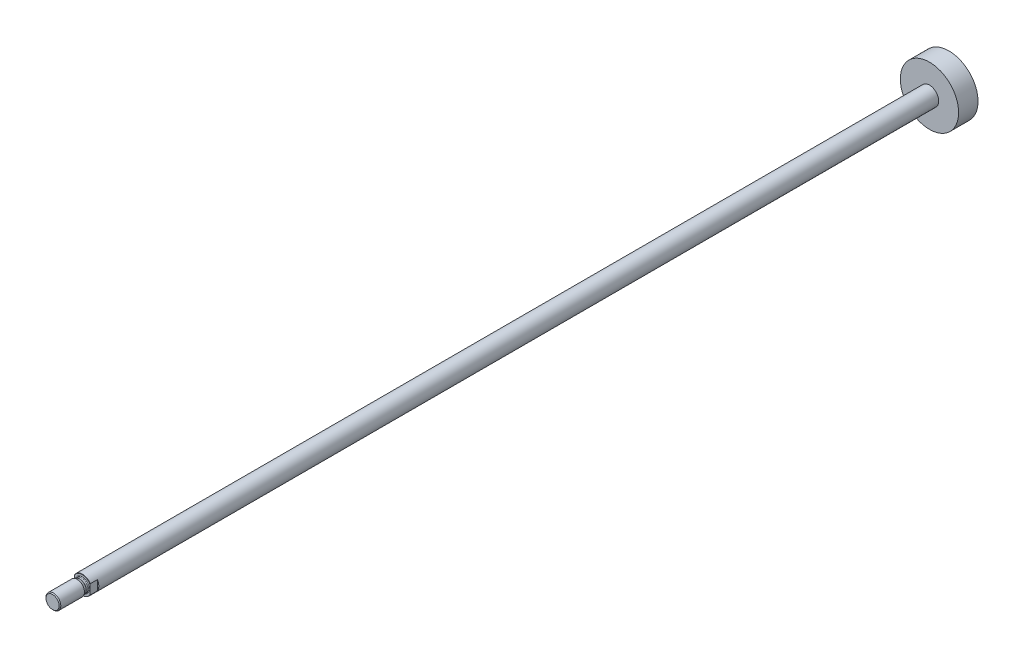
ISO-10303-21;
HEADER;
FILE_DESCRIPTION(('STEP AP214'),'2;1');
FILE_NAME('part.step','',(''),(''),'','','');
FILE_SCHEMA(('AUTOMOTIVE_DESIGN { 1 0 10303 214 1 1 1 1 }'));
ENDSEC;
DATA;
#1=APPLICATION_CONTEXT('core data for automotive mechanical design processes');
#2=APPLICATION_PROTOCOL_DEFINITION('international standard','automotive_design',2000,#1);
#3=PRODUCT_CONTEXT('',#1,'mechanical');
#4=PRODUCT('Part','Part','',(#3));
#5=PRODUCT_RELATED_PRODUCT_CATEGORY('part','',(#4));
#6=PRODUCT_DEFINITION_FORMATION('','',#4);
#7=PRODUCT_DEFINITION_CONTEXT('part definition',#1,'design');
#8=PRODUCT_DEFINITION('design','',#6,#7);
#9=PRODUCT_DEFINITION_SHAPE('','',#8);
#10=(LENGTH_UNIT() NAMED_UNIT(*) SI_UNIT(.MILLI.,.METRE.));
#11=(NAMED_UNIT(*) PLANE_ANGLE_UNIT() SI_UNIT($,.RADIAN.));
#12=(NAMED_UNIT(*) SI_UNIT($,.STERADIAN.) SOLID_ANGLE_UNIT());
#13=UNCERTAINTY_MEASURE_WITH_UNIT(LENGTH_MEASURE(1.E-05),#10,'distance_accuracy_value','');
#14=(GEOMETRIC_REPRESENTATION_CONTEXT(3) GLOBAL_UNCERTAINTY_ASSIGNED_CONTEXT((#13)) GLOBAL_UNIT_ASSIGNED_CONTEXT((#10,
#11,#12)) REPRESENTATION_CONTEXT('',''));
#15=CARTESIAN_POINT('',(0.,0.,0.));
#16=DIRECTION('',(0.,0.,1.));
#17=DIRECTION('',(1.,0.,0.));
#18=AXIS2_PLACEMENT_3D('',#15,#16,#17);
#19=CARTESIAN_POINT('',(0.,31.5,-580.5));
#20=DIRECTION('',(0.,0.,1.));
#21=DIRECTION('',(1.,0.,0.));
#22=AXIS2_PLACEMENT_3D('',#19,#20,#21);
#23=PLANE('',#22);
#24=CARTESIAN_POINT('',(0.,0.,-580.5));
#25=DIRECTION('',(0.,0.,-1.));
#26=DIRECTION('',(-1.,0.,0.));
#27=AXIS2_PLACEMENT_3D('',#24,#25,#26);
#28=CIRCLE('',#27,31.5);
#29=CARTESIAN_POINT('',(-31.5,0.,-580.5));
#30=VERTEX_POINT('',#29);
#31=EDGE_CURVE('E44',#30,#30,#28,.T.);
#32=ORIENTED_EDGE('',*,*,#31,.T.);
#33=EDGE_LOOP('',(#32));
#34=FACE_BOUND('',#33,.T.);
#35=ADVANCED_FACE('F41',(#34),#23,.F.);
#36=CARTESIAN_POINT('',(0.,0.,-580.5));
#37=DIRECTION('',(0.,0.,-1.));
#38=DIRECTION('',(-1.,0.,0.));
#39=AXIS2_PLACEMENT_3D('',#36,#37,#38);
#40=CYLINDRICAL_SURFACE('',#39,31.5);
#41=ORIENTED_EDGE('',*,*,#31,.F.);
#42=EDGE_LOOP('',(#41));
#43=FACE_BOUND('',#42,.T.);
#44=CARTESIAN_POINT('',(0.,0.,-559.5));
#45=DIRECTION('',(0.,0.,-1.));
#46=DIRECTION('',(-1.,0.,0.));
#47=AXIS2_PLACEMENT_3D('',#44,#45,#46);
#48=CIRCLE('',#47,31.5);
#49=CARTESIAN_POINT('',(-31.5,0.,-559.5));
#50=VERTEX_POINT('',#49);
#51=EDGE_CURVE('E51',#50,#50,#48,.T.);
#52=ORIENTED_EDGE('',*,*,#51,.T.);
#53=EDGE_LOOP('',(#52));
#54=FACE_BOUND('',#53,.T.);
#55=ADVANCED_FACE('F147',(#43,#54),#40,.T.);
#56=CARTESIAN_POINT('',(0.,10.,-559.5));
#57=DIRECTION('',(0.,0.,-1.));
#58=DIRECTION('',(0.,-1.,0.));
#59=AXIS2_PLACEMENT_3D('',#56,#57,#58);
#60=PLANE('',#59);
#61=ORIENTED_EDGE('',*,*,#51,.F.);
#62=EDGE_LOOP('',(#61));
#63=FACE_BOUND('',#62,.T.);
#64=CARTESIAN_POINT('',(0.,0.,-559.5));
#65=DIRECTION('',(0.,0.,-1.));
#66=DIRECTION('',(-1.,0.,0.));
#67=AXIS2_PLACEMENT_3D('',#64,#65,#66);
#68=CIRCLE('',#67,10.);
#69=CARTESIAN_POINT('',(-10.,0.,-559.5));
#70=VERTEX_POINT('',#69);
#71=EDGE_CURVE('E11',#70,#70,#68,.T.);
#72=ORIENTED_EDGE('',*,*,#71,.T.);
#73=EDGE_LOOP('',(#72));
#74=FACE_BOUND('',#73,.T.);
#75=ADVANCED_FACE('F329',(#63,#74),#60,.F.);
#76=CARTESIAN_POINT('',(0.,0.,-580.5));
#77=DIRECTION('',(0.,0.,-1.));
#78=DIRECTION('',(-1.,0.,0.));
#79=AXIS2_PLACEMENT_3D('',#76,#77,#78);
#80=CYLINDRICAL_SURFACE('',#79,10.);
#81=ORIENTED_EDGE('',*,*,#71,.F.);
#82=EDGE_LOOP('',(#81));
#83=FACE_BOUND('',#82,.T.);
#84=DIRECTION('',(0.,0.,-1.));
#85=VECTOR('',#84,1.);
#86=CARTESIAN_POINT('',(8.5,-5.26782687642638,-260.5));
#87=LINE('',#86,#85);
#88=CARTESIAN_POINT('',(8.5,-5.26782687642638,355.817157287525));
#89=VERTEX_POINT('',#88);
#90=CARTESIAN_POINT('',(8.5,-5.26782687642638,348.1));
#91=VERTEX_POINT('',#90);
#92=EDGE_CURVE('E189',#89,#91,#87,.T.);
#93=ORIENTED_EDGE('',*,*,#92,.F.);
#94=CARTESIAN_POINT('',(0.,0.,355.817157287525));
#95=DIRECTION('',(0.,0.,-1.));
#96=DIRECTION('',(-1.,0.,0.));
#97=AXIS2_PLACEMENT_3D('',#94,#95,#96);
#98=CIRCLE('',#97,10.);
#99=CARTESIAN_POINT('',(-8.5,-5.26782687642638,355.817157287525));
#100=VERTEX_POINT('',#99);
#101=EDGE_CURVE('E171',#89,#100,#98,.T.);
#102=ORIENTED_EDGE('',*,*,#101,.T.);
#103=DIRECTION('',(0.,0.,1.));
#104=VECTOR('',#103,1.);
#105=CARTESIAN_POINT('',(-8.5,-5.26782687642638,-260.5));
#106=LINE('',#105,#104);
#107=CARTESIAN_POINT('',(-8.5,-5.26782687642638,348.1));
#108=VERTEX_POINT('',#107);
#109=EDGE_CURVE('E235',#108,#100,#106,.T.);
#110=ORIENTED_EDGE('',*,*,#109,.F.);
#111=CARTESIAN_POINT('',(0.,0.,348.1));
#112=DIRECTION('',(0.,0.,1.));
#113=DIRECTION('',(1.,0.,0.));
#114=AXIS2_PLACEMENT_3D('',#111,#112,#113);
#115=CIRCLE('',#114,10.);
#116=CARTESIAN_POINT('',(-8.5,5.26782687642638,348.1));
#117=VERTEX_POINT('',#116);
#118=EDGE_CURVE('E183',#117,#108,#115,.T.);
#119=ORIENTED_EDGE('',*,*,#118,.F.);
#120=DIRECTION('',(0.,0.,-1.));
#121=VECTOR('',#120,1.);
#122=CARTESIAN_POINT('',(-8.5,5.26782687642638,-260.5));
#123=LINE('',#122,#121);
#124=CARTESIAN_POINT('',(-8.5,5.26782687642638,355.817157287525));
#125=VERTEX_POINT('',#124);
#126=EDGE_CURVE('E180',#125,#117,#123,.T.);
#127=ORIENTED_EDGE('',*,*,#126,.F.);
#128=CARTESIAN_POINT('',(0.,0.,355.817157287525));
#129=DIRECTION('',(0.,0.,-1.));
#130=DIRECTION('',(-1.,0.,0.));
#131=AXIS2_PLACEMENT_3D('',#128,#129,#130);
#132=CIRCLE('',#131,10.);
#133=CARTESIAN_POINT('',(8.5,5.26782687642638,355.817157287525));
#134=VERTEX_POINT('',#133);
#135=EDGE_CURVE('E175',#125,#134,#132,.T.);
#136=ORIENTED_EDGE('',*,*,#135,.T.);
#137=DIRECTION('',(0.,0.,1.));
#138=VECTOR('',#137,1.);
#139=CARTESIAN_POINT('',(8.5,5.26782687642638,-260.5));
#140=LINE('',#139,#138);
#141=CARTESIAN_POINT('',(8.5,5.26782687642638,348.1));
#142=VERTEX_POINT('',#141);
#143=EDGE_CURVE('E192',#142,#134,#140,.T.);
#144=ORIENTED_EDGE('',*,*,#143,.F.);
#145=CARTESIAN_POINT('',(0.,0.,348.1));
#146=DIRECTION('',(0.,0.,1.));
#147=DIRECTION('',(1.,0.,0.));
#148=AXIS2_PLACEMENT_3D('',#145,#146,#147);
#149=CIRCLE('',#148,10.);
#150=EDGE_CURVE('E272',#91,#142,#149,.T.);
#151=ORIENTED_EDGE('',*,*,#150,.F.);
#152=EDGE_LOOP('',(#93,#102,#110,#119,#127,#136,#144,#151));
#153=FACE_BOUND('',#152,.T.);
#154=ADVANCED_FACE('F254',(#83,#153),#80,.T.);
#155=CARTESIAN_POINT('',(0.,0.,356.1));
#156=DIRECTION('',(0.,0.,-1.));
#157=DIRECTION('',(0.,-1.,0.));
#158=AXIS2_PLACEMENT_3D('',#155,#156,#157);
#159=PLANE('',#158);
#160=CARTESIAN_POINT('',(0.,0.,356.1));
#161=DIRECTION('',(0.,0.,-1.));
#162=DIRECTION('',(-1.,0.,0.));
#163=AXIS2_PLACEMENT_3D('',#160,#161,#162);
#164=CIRCLE('',#163,9.71715728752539);
#165=CARTESIAN_POINT('',(-8.5,4.70883698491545,356.1));
#166=VERTEX_POINT('',#165);
#167=CARTESIAN_POINT('',(8.5,4.70883698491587,356.1));
#168=VERTEX_POINT('',#167);
#169=EDGE_CURVE('E218',#166,#168,#164,.T.);
#170=ORIENTED_EDGE('',*,*,#169,.F.);
#171=DIRECTION('',(0.,1.,0.));
#172=VECTOR('',#171,1.);
#173=CARTESIAN_POINT('',(-8.5,0.,356.1));
#174=LINE('',#173,#172);
#175=CARTESIAN_POINT('',(-8.5,-4.70883698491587,356.1));
#176=VERTEX_POINT('',#175);
#177=EDGE_CURVE('E219',#176,#166,#174,.T.);
#178=ORIENTED_EDGE('',*,*,#177,.F.);
#179=CARTESIAN_POINT('',(0.,0.,356.1));
#180=DIRECTION('',(0.,0.,-1.));
#181=DIRECTION('',(-1.,0.,0.));
#182=AXIS2_PLACEMENT_3D('',#179,#180,#181);
#183=CIRCLE('',#182,9.71715728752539);
#184=CARTESIAN_POINT('',(8.5,-4.70883698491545,356.1));
#185=VERTEX_POINT('',#184);
#186=EDGE_CURVE('E211',#185,#176,#183,.T.);
#187=ORIENTED_EDGE('',*,*,#186,.F.);
#188=DIRECTION('',(0.,-1.,0.));
#189=VECTOR('',#188,1.);
#190=CARTESIAN_POINT('',(8.5,0.,356.1));
#191=LINE('',#190,#189);
#192=EDGE_CURVE('E184',#168,#185,#191,.T.);
#193=ORIENTED_EDGE('',*,*,#192,.F.);
#194=EDGE_LOOP('',(#170,#178,#187,#193));
#195=FACE_BOUND('',#194,.T.);
#196=CARTESIAN_POINT('',(0.,0.,356.1));
#197=DIRECTION('',(0.,0.,-1.));
#198=DIRECTION('',(-1.,0.,0.));
#199=AXIS2_PLACEMENT_3D('',#196,#197,#198);
#200=CIRCLE('',#199,7.7);
#201=CARTESIAN_POINT('',(-7.7,0.,356.1));
#202=VERTEX_POINT('',#201);
#203=EDGE_CURVE('E141',#202,#202,#200,.T.);
#204=ORIENTED_EDGE('',*,*,#203,.T.);
#205=EDGE_LOOP('',(#204));
#206=FACE_BOUND('',#205,.T.);
#207=ADVANCED_FACE('F266',(#195,#206),#159,.F.);
#208=CARTESIAN_POINT('',(0.,0.,356.1));
#209=DIRECTION('',(0.,0.,-1.));
#210=DIRECTION('',(-1.,0.,0.));
#211=AXIS2_PLACEMENT_3D('',#208,#209,#210);
#212=CONICAL_SURFACE('',#211,9.71715728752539,0.78539816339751);
#213=CARTESIAN_POINT('',(8.5,-4.70883698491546,356.1));
#214=CARTESIAN_POINT('',(8.5,-4.89640601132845,356.009105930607));
#215=CARTESIAN_POINT('',(8.5,-5.08268534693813,355.914686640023));
#216=CARTESIAN_POINT('',(8.5,-5.26782687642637,355.817157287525));
#217=(BOUNDED_CURVE() B_SPLINE_CURVE(3,(#213,#214,#215,#216),.UNSPECIFIED.,.F.,
.F.) B_SPLINE_CURVE_WITH_KNOTS((4,4),(0.0103936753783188,0.011015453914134),
.UNSPECIFIED.) CURVE() GEOMETRIC_REPRESENTATION_ITEM() RATIONAL_B_SPLINE_CURVE((1.,1.,1.,1.)) REPRESENTATION_ITEM(''));
#218=EDGE_CURVE('E187',#185,#89,#217,.T.);
#219=ORIENTED_EDGE('',*,*,#218,.F.);
#220=ORIENTED_EDGE('',*,*,#186,.T.);
#221=CARTESIAN_POINT('',(-8.5,-5.26782687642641,355.817157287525));
#222=CARTESIAN_POINT('',(-8.5,-5.08267754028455,355.914690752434));
#223=CARTESIAN_POINT('',(-8.5,-4.89639776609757,356.009109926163));
#224=CARTESIAN_POINT('',(-8.5,-4.7088369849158,356.1));
#225=(BOUNDED_CURVE() B_SPLINE_CURVE(3,(#221,#222,#223,#224),.UNSPECIFIED.,.F.,
.F.) B_SPLINE_CURVE_WITH_KNOTS((4,4),(1.48780611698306E-06,0.00062343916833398),
.UNSPECIFIED.) CURVE() GEOMETRIC_REPRESENTATION_ITEM() RATIONAL_B_SPLINE_CURVE((1.,1.,1.,1.)) REPRESENTATION_ITEM(''));
#226=EDGE_CURVE('E222',#100,#176,#225,.T.);
#227=ORIENTED_EDGE('',*,*,#226,.F.);
#228=ORIENTED_EDGE('',*,*,#101,.F.);
#229=EDGE_LOOP('',(#219,#220,#227,#228));
#230=FACE_BOUND('',#229,.T.);
#231=ADVANCED_FACE('F259',(#230),#212,.T.);
#232=CARTESIAN_POINT('',(0.,0.,356.1));
#233=DIRECTION('',(0.,0.,-1.));
#234=DIRECTION('',(-1.,0.,0.));
#235=AXIS2_PLACEMENT_3D('',#232,#233,#234);
#236=CONICAL_SURFACE('',#235,9.71715728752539,0.78539816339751);
#237=CARTESIAN_POINT('',(-8.5,4.70883698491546,356.1));
#238=CARTESIAN_POINT('',(-8.5,4.89640601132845,356.009105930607));
#239=CARTESIAN_POINT('',(-8.5,5.08268534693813,355.914686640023));
#240=CARTESIAN_POINT('',(-8.5,5.26782687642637,355.817157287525));
#241=(BOUNDED_CURVE() B_SPLINE_CURVE(3,(#237,#238,#239,#240),.UNSPECIFIED.,.F.,
.F.) B_SPLINE_CURVE_WITH_KNOTS((4,4),(0.0103936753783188,0.011015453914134),
.UNSPECIFIED.) CURVE() GEOMETRIC_REPRESENTATION_ITEM() RATIONAL_B_SPLINE_CURVE((1.,1.,1.,1.)) REPRESENTATION_ITEM(''));
#242=EDGE_CURVE('E221',#166,#125,#241,.T.);
#243=ORIENTED_EDGE('',*,*,#242,.F.);
#244=ORIENTED_EDGE('',*,*,#169,.T.);
#245=CARTESIAN_POINT('',(8.5,5.26782687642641,355.817157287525));
#246=CARTESIAN_POINT('',(8.5,5.08267754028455,355.914690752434));
#247=CARTESIAN_POINT('',(8.5,4.89639776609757,356.009109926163));
#248=CARTESIAN_POINT('',(8.5,4.7088369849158,356.1));
#249=(BOUNDED_CURVE() B_SPLINE_CURVE(3,(#245,#246,#247,#248),.UNSPECIFIED.,.F.,
.F.) B_SPLINE_CURVE_WITH_KNOTS((4,4),(1.48780611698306E-06,0.00062343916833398),
.UNSPECIFIED.) CURVE() GEOMETRIC_REPRESENTATION_ITEM() RATIONAL_B_SPLINE_CURVE((1.,1.,1.,1.)) REPRESENTATION_ITEM(''));
#250=EDGE_CURVE('E188',#134,#168,#249,.T.);
#251=ORIENTED_EDGE('',*,*,#250,.F.);
#252=ORIENTED_EDGE('',*,*,#135,.F.);
#253=EDGE_LOOP('',(#243,#244,#251,#252));
#254=FACE_BOUND('',#253,.T.);
#255=ADVANCED_FACE('F270',(#254),#236,.T.);
#256=CARTESIAN_POINT('',(-8.5,17.,348.1));
#257=DIRECTION('',(0.,0.,1.));
#258=DIRECTION('',(1.,0.,0.));
#259=AXIS2_PLACEMENT_3D('',#256,#257,#258);
#260=PLANE('',#259);
#261=ORIENTED_EDGE('',*,*,#118,.T.);
#262=DIRECTION('',(0.,-1.,0.));
#263=VECTOR('',#262,1.);
#264=CARTESIAN_POINT('',(-8.5,17.,348.1));
#265=LINE('',#264,#263);
#266=EDGE_CURVE('E169',#117,#108,#265,.T.);
#267=ORIENTED_EDGE('',*,*,#266,.F.);
#268=EDGE_LOOP('',(#261,#267));
#269=FACE_BOUND('',#268,.T.);
#270=ADVANCED_FACE('F251',(#269),#260,.T.);
#271=CARTESIAN_POINT('',(-8.5,17.,364.1));
#272=DIRECTION('',(-1.,0.,0.));
#273=DIRECTION('',(0.,0.,1.));
#274=AXIS2_PLACEMENT_3D('',#271,#272,#273);
#275=PLANE('',#274);
#276=ORIENTED_EDGE('',*,*,#126,.T.);
#277=ORIENTED_EDGE('',*,*,#266,.T.);
#278=ORIENTED_EDGE('',*,*,#109,.T.);
#279=ORIENTED_EDGE('',*,*,#226,.T.);
#280=ORIENTED_EDGE('',*,*,#177,.T.);
#281=ORIENTED_EDGE('',*,*,#242,.T.);
#282=EDGE_LOOP('',(#276,#277,#278,#279,#280,#281));
#283=FACE_BOUND('',#282,.T.);
#284=ADVANCED_FACE('F247',(#283),#275,.T.);
#285=CARTESIAN_POINT('',(17.,17.,348.1));
#286=DIRECTION('',(0.,0.,1.));
#287=DIRECTION('',(1.,0.,0.));
#288=AXIS2_PLACEMENT_3D('',#285,#286,#287);
#289=PLANE('',#288);
#290=ORIENTED_EDGE('',*,*,#150,.T.);
#291=DIRECTION('',(0.,-1.,0.));
#292=VECTOR('',#291,1.);
#293=CARTESIAN_POINT('',(8.5,17.,348.1));
#294=LINE('',#293,#292);
#295=EDGE_CURVE('E193',#142,#91,#294,.T.);
#296=ORIENTED_EDGE('',*,*,#295,.T.);
#297=EDGE_LOOP('',(#290,#296));
#298=FACE_BOUND('',#297,.T.);
#299=ADVANCED_FACE('F318',(#298),#289,.T.);
#300=CARTESIAN_POINT('',(8.5,17.,348.1));
#301=DIRECTION('',(1.,0.,0.));
#302=DIRECTION('',(0.,1.,0.));
#303=AXIS2_PLACEMENT_3D('',#300,#301,#302);
#304=PLANE('',#303);
#305=ORIENTED_EDGE('',*,*,#92,.T.);
#306=ORIENTED_EDGE('',*,*,#295,.F.);
#307=ORIENTED_EDGE('',*,*,#143,.T.);
#308=ORIENTED_EDGE('',*,*,#250,.T.);
#309=ORIENTED_EDGE('',*,*,#192,.T.);
#310=ORIENTED_EDGE('',*,*,#218,.T.);
#311=EDGE_LOOP('',(#305,#306,#307,#308,#309,#310));
#312=FACE_BOUND('',#311,.T.);
#313=ADVANCED_FACE('F313',(#312),#304,.T.);
#314=CARTESIAN_POINT('',(0.,0.,388.1));
#315=DIRECTION('',(0.,0.,-1.));
#316=DIRECTION('',(0.,-1.,0.));
#317=AXIS2_PLACEMENT_3D('',#314,#315,#316);
#318=PLANE('',#317);
#319=CARTESIAN_POINT('',(0.,0.,388.1));
#320=DIRECTION('',(0.,0.,-1.));
#321=DIRECTION('',(-1.,0.,0.));
#322=AXIS2_PLACEMENT_3D('',#319,#320,#321);
#323=CIRCLE('',#322,7.08);
#324=CARTESIAN_POINT('',(-7.08,0.,388.1));
#325=VERTEX_POINT('',#324);
#326=EDGE_CURVE('E198',#325,#325,#323,.T.);
#327=ORIENTED_EDGE('',*,*,#326,.F.);
#328=EDGE_LOOP('',(#327));
#329=FACE_BOUND('',#328,.T.);
#330=ADVANCED_FACE('F309',(#329),#318,.F.);
#331=CARTESIAN_POINT('',(0.,0.,388.1));
#332=DIRECTION('',(0.,0.,-1.));
#333=DIRECTION('',(-1.,0.,0.));
#334=AXIS2_PLACEMENT_3D('',#331,#332,#333);
#335=CONICAL_SURFACE('',#334,7.08,0.785398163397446);
#336=CARTESIAN_POINT('',(0.,0.,387.18));
#337=DIRECTION('',(0.,0.,-1.));
#338=DIRECTION('',(-1.,0.,0.));
#339=AXIS2_PLACEMENT_3D('',#336,#337,#338);
#340=CIRCLE('',#339,8.);
#341=CARTESIAN_POINT('',(-8.,0.,387.18));
#342=VERTEX_POINT('',#341);
#343=EDGE_CURVE('E205',#342,#342,#340,.T.);
#344=ORIENTED_EDGE('',*,*,#343,.F.);
#345=EDGE_LOOP('',(#344));
#346=FACE_BOUND('',#345,.T.);
#347=ORIENTED_EDGE('',*,*,#326,.T.);
#348=EDGE_LOOP('',(#347));
#349=FACE_BOUND('',#348,.T.);
#350=ADVANCED_FACE('F304',(#346,#349),#335,.T.);
#351=CARTESIAN_POINT('',(0.,0.,355.35));
#352=DIRECTION('',(0.,0.,-1.));
#353=DIRECTION('',(-1.,0.,0.));
#354=AXIS2_PLACEMENT_3D('',#351,#352,#353);
#355=CYLINDRICAL_SURFACE('',#354,8.);
#356=CARTESIAN_POINT('',(0.,0.,361.584851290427));
#357=DIRECTION('',(0.,0.,-1.));
#358=DIRECTION('',(-1.,0.,0.));
#359=AXIS2_PLACEMENT_3D('',#356,#357,#358);
#360=CIRCLE('',#359,8.);
#361=CARTESIAN_POINT('',(-8.,0.,361.584851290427));
#362=VERTEX_POINT('',#361);
#363=EDGE_CURVE('E179',#362,#362,#360,.T.);
#364=ORIENTED_EDGE('',*,*,#363,.F.);
#365=EDGE_LOOP('',(#364));
#366=FACE_BOUND('',#365,.T.);
#367=ORIENTED_EDGE('',*,*,#343,.T.);
#368=EDGE_LOOP('',(#367));
#369=FACE_BOUND('',#368,.T.);
#370=ADVANCED_FACE('F301',(#366,#369),#355,.T.);
#371=CARTESIAN_POINT('',(0.,0.,361.584851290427));
#372=DIRECTION('',(0.,0.,1.));
#373=DIRECTION('',(1.,0.,0.));
#374=AXIS2_PLACEMENT_3D('',#371,#372,#373);
#375=CONICAL_SURFACE('',#374,8.,0.349065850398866);
#376=CARTESIAN_POINT('',(0.,0.,358.824269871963));
#377=DIRECTION('',(0.,0.,-1.));
#378=DIRECTION('',(-1.,0.,0.));
#379=AXIS2_PLACEMENT_3D('',#376,#377,#378);
#380=CIRCLE('',#379,6.99523053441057);
#381=CARTESIAN_POINT('',(-6.99523053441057,0.,358.824269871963));
#382=VERTEX_POINT('',#381);
#383=EDGE_CURVE('E165',#382,#382,#380,.T.);
#384=ORIENTED_EDGE('',*,*,#383,.F.);
#385=EDGE_LOOP('',(#384));
#386=FACE_BOUND('',#385,.T.);
#387=ORIENTED_EDGE('',*,*,#363,.T.);
#388=EDGE_LOOP('',(#387));
#389=FACE_BOUND('',#388,.T.);
#390=ADVANCED_FACE('F299',(#386,#389),#375,.T.);
#391=CARTESIAN_POINT('',(0.,0.,358.567754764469));
#392=DIRECTION('',(0.,0.,-1.));
#393=DIRECTION('',(-1.,0.,0.));
#394=AXIS2_PLACEMENT_3D('',#391,#392,#393);
#395=TOROIDAL_SURFACE('',#394,7.7,0.749999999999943);
#396=CARTESIAN_POINT('',(0.,0.,358.567754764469));
#397=DIRECTION('',(0.,0.,-1.));
#398=DIRECTION('',(-1.,0.,0.));
#399=AXIS2_PLACEMENT_3D('',#396,#397,#398);
#400=CIRCLE('',#399,6.95);
#401=CARTESIAN_POINT('',(-6.95,0.,358.567754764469));
#402=VERTEX_POINT('',#401);
#403=EDGE_CURVE('E159',#402,#402,#400,.T.);
#404=ORIENTED_EDGE('',*,*,#403,.F.);
#405=EDGE_LOOP('',(#404));
#406=FACE_BOUND('',#405,.T.);
#407=ORIENTED_EDGE('',*,*,#383,.T.);
#408=EDGE_LOOP('',(#407));
#409=FACE_BOUND('',#408,.T.);
#410=ADVANCED_FACE('F355',(#406,#409),#395,.F.);
#411=CARTESIAN_POINT('',(0.,0.,355.35));
#412=DIRECTION('',(0.,0.,-1.));
#413=DIRECTION('',(-1.,0.,0.));
#414=AXIS2_PLACEMENT_3D('',#411,#412,#413);
#415=CYLINDRICAL_SURFACE('',#414,6.95);
#416=CARTESIAN_POINT('',(0.,0.,356.85));
#417=DIRECTION('',(0.,0.,-1.));
#418=DIRECTION('',(-1.,0.,0.));
#419=AXIS2_PLACEMENT_3D('',#416,#417,#418);
#420=CIRCLE('',#419,6.95);
#421=CARTESIAN_POINT('',(-6.95,0.,356.85));
#422=VERTEX_POINT('',#421);
#423=EDGE_CURVE('E151',#422,#422,#420,.T.);
#424=ORIENTED_EDGE('',*,*,#423,.F.);
#425=EDGE_LOOP('',(#424));
#426=FACE_BOUND('',#425,.T.);
#427=ORIENTED_EDGE('',*,*,#403,.T.);
#428=EDGE_LOOP('',(#427));
#429=FACE_BOUND('',#428,.T.);
#430=ADVANCED_FACE('F357',(#426,#429),#415,.T.);
#431=CARTESIAN_POINT('',(0.,0.,356.85));
#432=DIRECTION('',(0.,0.,-1.));
#433=DIRECTION('',(-1.,0.,0.));
#434=AXIS2_PLACEMENT_3D('',#431,#432,#433);
#435=TOROIDAL_SURFACE('',#434,7.7,0.75);
#436=ORIENTED_EDGE('',*,*,#203,.F.);
#437=EDGE_LOOP('',(#436));
#438=FACE_BOUND('',#437,.T.);
#439=ORIENTED_EDGE('',*,*,#423,.T.);
#440=EDGE_LOOP('',(#439));
#441=FACE_BOUND('',#440,.T.);
#442=ADVANCED_FACE('F359',(#438,#441),#435,.F.);
#443=CLOSED_SHELL('',(#35,#55,#75,#154,#207,#231,#255,#270,#284,#299,#313,#330,#350,#370,#390,
#410,#430,#442));
#444=MANIFOLD_SOLID_BREP('B2',#443);
#445=ADVANCED_BREP_SHAPE_REPRESENTATION('',(#18,#444),#14);
#446=SHAPE_DEFINITION_REPRESENTATION(#9,#445);
ENDSEC;
END-ISO-10303-21;
